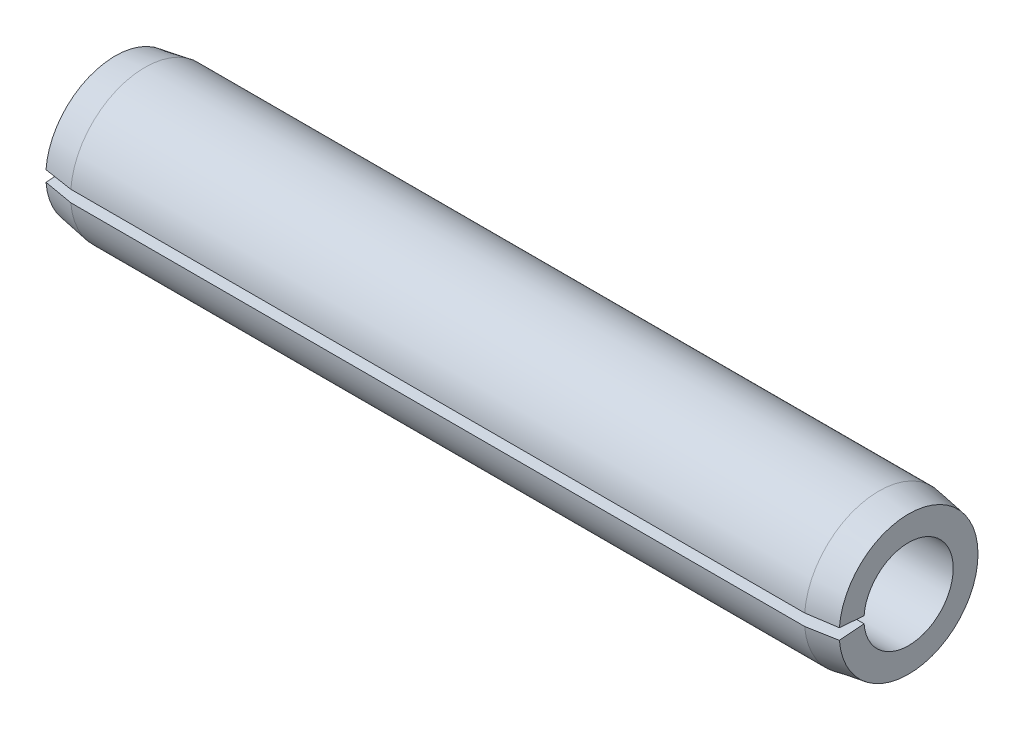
ISO-10303-21;
HEADER;
FILE_DESCRIPTION(('STEP AP214'),'2;1');
FILE_NAME('part.step','',(''),(''),'','','');
FILE_SCHEMA(('AUTOMOTIVE_DESIGN { 1 0 10303 214 1 1 1 1 }'));
ENDSEC;
DATA;
#1=APPLICATION_CONTEXT('core data for automotive mechanical design processes');
#2=APPLICATION_PROTOCOL_DEFINITION('international standard','automotive_design',2000,#1);
#3=PRODUCT_CONTEXT('',#1,'mechanical');
#4=PRODUCT('Part','Part','',(#3));
#5=PRODUCT_RELATED_PRODUCT_CATEGORY('part','',(#4));
#6=PRODUCT_DEFINITION_FORMATION('','',#4);
#7=PRODUCT_DEFINITION_CONTEXT('part definition',#1,'design');
#8=PRODUCT_DEFINITION('design','',#6,#7);
#9=PRODUCT_DEFINITION_SHAPE('','',#8);
#10=(LENGTH_UNIT() NAMED_UNIT(*) SI_UNIT(.MILLI.,.METRE.));
#11=(NAMED_UNIT(*) PLANE_ANGLE_UNIT() SI_UNIT($,.RADIAN.));
#12=(NAMED_UNIT(*) SI_UNIT($,.STERADIAN.) SOLID_ANGLE_UNIT());
#13=UNCERTAINTY_MEASURE_WITH_UNIT(LENGTH_MEASURE(1.E-05),#10,'distance_accuracy_value','');
#14=(GEOMETRIC_REPRESENTATION_CONTEXT(3) GLOBAL_UNCERTAINTY_ASSIGNED_CONTEXT((#13)) GLOBAL_UNIT_ASSIGNED_CONTEXT((#10,
#11,#12)) REPRESENTATION_CONTEXT('',''));
#15=CARTESIAN_POINT('',(0.,0.,0.));
#16=DIRECTION('',(0.,0.,1.));
#17=DIRECTION('',(1.,0.,0.));
#18=AXIS2_PLACEMENT_3D('',#15,#16,#17);
#19=CARTESIAN_POINT('',(0.,8.89,0.));
#20=DIRECTION('',(1.,0.,0.));
#21=DIRECTION('',(0.,0.,-1.));
#22=AXIS2_PLACEMENT_3D('',#19,#20,#21);
#23=PLANE('',#22);
#24=DIRECTION('',(0.,0.0784590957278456,0.996917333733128));
#25=VECTOR('',#24,1.);
#26=CARTESIAN_POINT('',(0.,0.,0.));
#27=LINE('',#26,#25);
#28=CARTESIAN_POINT('',(0.,0.448393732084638,5.69738256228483));
#29=VERTEX_POINT('',#28);
#30=CARTESIAN_POINT('',(0.,0.697501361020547,8.86259509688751));
#31=VERTEX_POINT('',#30);
#32=EDGE_CURVE('E82',#29,#31,#27,.T.);
#33=ORIENTED_EDGE('',*,*,#32,.T.);
#34=CARTESIAN_POINT('',(0.,0.,0.));
#35=DIRECTION('',(-1.,0.,0.));
#36=DIRECTION('',(0.,0.,1.));
#37=AXIS2_PLACEMENT_3D('',#34,#35,#36);
#38=CIRCLE('',#37,8.89);
#39=CARTESIAN_POINT('',(0.,-0.697501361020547,8.86259509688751));
#40=VERTEX_POINT('',#39);
#41=EDGE_CURVE('E100',#31,#40,#38,.T.);
#42=ORIENTED_EDGE('',*,*,#41,.T.);
#43=DIRECTION('',(0.,-0.0784590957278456,0.996917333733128));
#44=VECTOR('',#43,1.);
#45=CARTESIAN_POINT('',(0.,0.,0.));
#46=LINE('',#45,#44);
#47=CARTESIAN_POINT('',(0.,-0.448393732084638,5.69738256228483));
#48=VERTEX_POINT('',#47);
#49=EDGE_CURVE('E54',#48,#40,#46,.T.);
#50=ORIENTED_EDGE('',*,*,#49,.F.);
#51=CARTESIAN_POINT('',(0.,0.,0.));
#52=DIRECTION('',(-1.,0.,0.));
#53=DIRECTION('',(0.,0.,1.));
#54=AXIS2_PLACEMENT_3D('',#51,#52,#53);
#55=CIRCLE('',#54,5.715);
#56=EDGE_CURVE('E97',#29,#48,#55,.T.);
#57=ORIENTED_EDGE('',*,*,#56,.F.);
#58=EDGE_LOOP('',(#33,#42,#50,#57));
#59=FACE_BOUND('',#58,.T.);
#60=ADVANCED_FACE('F33',(#59),#23,.F.);
#61=CARTESIAN_POINT('',(-9.52499999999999,0.,0.));
#62=DIRECTION('',(-1.,0.,0.));
#63=DIRECTION('',(0.,0.,1.));
#64=AXIS2_PLACEMENT_3D('',#61,#62,#63);
#65=CYLINDRICAL_SURFACE('',#64,5.715);
#66=DIRECTION('',(-1.,0.,0.));
#67=VECTOR('',#66,1.);
#68=CARTESIAN_POINT('',(-9.52499999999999,0.448393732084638,5.69738256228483));
#69=LINE('',#68,#67);
#70=CARTESIAN_POINT('',(101.6,0.448393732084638,5.69738256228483));
#71=VERTEX_POINT('',#70);
#72=EDGE_CURVE('E85',#29,#71,#69,.F.);
#73=ORIENTED_EDGE('',*,*,#72,.F.);
#74=ORIENTED_EDGE('',*,*,#56,.T.);
#75=DIRECTION('',(-1.,0.,0.));
#76=VECTOR('',#75,1.);
#77=CARTESIAN_POINT('',(-9.52499999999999,-0.448393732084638,5.69738256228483));
#78=LINE('',#77,#76);
#79=CARTESIAN_POINT('',(101.6,-0.448393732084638,5.69738256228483));
#80=VERTEX_POINT('',#79);
#81=EDGE_CURVE('E118',#48,#80,#78,.F.);
#82=ORIENTED_EDGE('',*,*,#81,.T.);
#83=CARTESIAN_POINT('',(101.6,0.,0.));
#84=DIRECTION('',(-1.,0.,0.));
#85=DIRECTION('',(0.,0.,1.));
#86=AXIS2_PLACEMENT_3D('',#83,#84,#85);
#87=CIRCLE('',#86,5.715);
#88=EDGE_CURVE('E99',#71,#80,#87,.T.);
#89=ORIENTED_EDGE('',*,*,#88,.F.);
#90=EDGE_LOOP('',(#73,#74,#82,#89));
#91=FACE_BOUND('',#90,.T.);
#92=ADVANCED_FACE('F95',(#91),#65,.F.);
#93=CARTESIAN_POINT('',(101.6,5.715,0.));
#94=DIRECTION('',(-1.,0.,0.));
#95=DIRECTION('',(0.,0.,1.));
#96=AXIS2_PLACEMENT_3D('',#93,#94,#95);
#97=PLANE('',#96);
#98=DIRECTION('',(0.,0.0784590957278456,0.996917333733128));
#99=VECTOR('',#98,1.);
#100=CARTESIAN_POINT('',(101.6,0.,0.));
#101=LINE('',#100,#99);
#102=CARTESIAN_POINT('',(101.6,0.697501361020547,8.86259509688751));
#103=VERTEX_POINT('',#102);
#104=EDGE_CURVE('E127',#71,#103,#101,.T.);
#105=ORIENTED_EDGE('',*,*,#104,.F.);
#106=ORIENTED_EDGE('',*,*,#88,.T.);
#107=DIRECTION('',(0.,-0.0784590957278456,0.996917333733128));
#108=VECTOR('',#107,1.);
#109=CARTESIAN_POINT('',(101.6,0.,0.));
#110=LINE('',#109,#108);
#111=CARTESIAN_POINT('',(101.6,-0.697501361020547,8.86259509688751));
#112=VERTEX_POINT('',#111);
#113=EDGE_CURVE('E126',#80,#112,#110,.T.);
#114=ORIENTED_EDGE('',*,*,#113,.T.);
#115=CARTESIAN_POINT('',(101.6,0.,0.));
#116=DIRECTION('',(-1.,0.,0.));
#117=DIRECTION('',(0.,0.,1.));
#118=AXIS2_PLACEMENT_3D('',#115,#116,#117);
#119=CIRCLE('',#118,8.89);
#120=EDGE_CURVE('E104',#103,#112,#119,.T.);
#121=ORIENTED_EDGE('',*,*,#120,.F.);
#122=EDGE_LOOP('',(#105,#106,#114,#121));
#123=FACE_BOUND('',#122,.T.);
#124=ADVANCED_FACE('F137',(#123),#97,.F.);
#125=CARTESIAN_POINT('',(101.6,0.,0.));
#126=DIRECTION('',(-1.,0.,0.));
#127=DIRECTION('',(0.,0.,1.));
#128=AXIS2_PLACEMENT_3D('',#125,#126,#127);
#129=CONICAL_SURFACE('',#128,8.89,0.165148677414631);
#130=DIRECTION('',(-0.986393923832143,0.0128985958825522,0.163892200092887));
#131=VECTOR('',#130,1.);
#132=CARTESIAN_POINT('',(154.939999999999,0.,0.));
#133=LINE('',#132,#131);
#134=CARTESIAN_POINT('',(97.79,0.74732288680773,9.49563760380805));
#135=VERTEX_POINT('',#134);
#136=EDGE_CURVE('E101',#103,#135,#133,.T.);
#137=ORIENTED_EDGE('',*,*,#136,.F.);
#138=ORIENTED_EDGE('',*,*,#120,.T.);
#139=DIRECTION('',(-0.986393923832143,-0.0128985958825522,0.163892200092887));
#140=VECTOR('',#139,1.);
#141=CARTESIAN_POINT('',(154.939999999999,0.,0.));
#142=LINE('',#141,#140);
#143=CARTESIAN_POINT('',(97.79,-0.74732288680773,9.49563760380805));
#144=VERTEX_POINT('',#143);
#145=EDGE_CURVE('E120',#112,#144,#142,.T.);
#146=ORIENTED_EDGE('',*,*,#145,.T.);
#147=CARTESIAN_POINT('',(97.79,0.,0.));
#148=DIRECTION('',(-1.,0.,0.));
#149=DIRECTION('',(0.,0.,1.));
#150=AXIS2_PLACEMENT_3D('',#147,#148,#149);
#151=CIRCLE('',#150,9.52500000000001);
#152=EDGE_CURVE('E109',#135,#144,#151,.T.);
#153=ORIENTED_EDGE('',*,*,#152,.F.);
#154=EDGE_LOOP('',(#137,#138,#146,#153));
#155=FACE_BOUND('',#154,.T.);
#156=ADVANCED_FACE('F136',(#155),#129,.T.);
#157=CARTESIAN_POINT('',(-9.52499999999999,0.,0.));
#158=DIRECTION('',(-1.,0.,0.));
#159=DIRECTION('',(0.,0.,1.));
#160=AXIS2_PLACEMENT_3D('',#157,#158,#159);
#161=CYLINDRICAL_SURFACE('',#160,9.52500000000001);
#162=DIRECTION('',(-1.,0.,0.));
#163=VECTOR('',#162,1.);
#164=CARTESIAN_POINT('',(-9.52499999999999,0.74732288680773,9.49563760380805));
#165=LINE('',#164,#163);
#166=CARTESIAN_POINT('',(3.81,0.747322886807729,9.49563760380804));
#167=VERTEX_POINT('',#166);
#168=EDGE_CURVE('E46',#135,#167,#165,.T.);
#169=ORIENTED_EDGE('',*,*,#168,.F.);
#170=ORIENTED_EDGE('',*,*,#152,.T.);
#171=DIRECTION('',(-1.,0.,0.));
#172=VECTOR('',#171,1.);
#173=CARTESIAN_POINT('',(-9.52499999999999,-0.74732288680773,9.49563760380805));
#174=LINE('',#173,#172);
#175=CARTESIAN_POINT('',(3.81,-0.747322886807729,9.49563760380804));
#176=VERTEX_POINT('',#175);
#177=EDGE_CURVE('E123',#144,#176,#174,.T.);
#178=ORIENTED_EDGE('',*,*,#177,.T.);
#179=CARTESIAN_POINT('',(3.81,0.,0.));
#180=DIRECTION('',(-1.,0.,0.));
#181=DIRECTION('',(0.,0.,1.));
#182=AXIS2_PLACEMENT_3D('',#179,#180,#181);
#183=CIRCLE('',#182,9.525);
#184=EDGE_CURVE('E112',#167,#176,#183,.T.);
#185=ORIENTED_EDGE('',*,*,#184,.F.);
#186=EDGE_LOOP('',(#169,#170,#178,#185));
#187=FACE_BOUND('',#186,.T.);
#188=ADVANCED_FACE('F140',(#187),#161,.T.);
#189=CARTESIAN_POINT('',(3.81,0.,0.));
#190=DIRECTION('',(1.,0.,0.));
#191=DIRECTION('',(0.,0.,-1.));
#192=AXIS2_PLACEMENT_3D('',#189,#190,#191);
#193=CONICAL_SURFACE('',#192,9.525,0.165148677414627);
#194=DIRECTION('',(-0.986393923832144,-0.0128985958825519,-0.163892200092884));
#195=VECTOR('',#194,1.);
#196=CARTESIAN_POINT('',(-53.3399999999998,0.,0.));
#197=LINE('',#196,#195);
#198=EDGE_CURVE('E11',#167,#31,#197,.T.);
#199=ORIENTED_EDGE('',*,*,#198,.F.);
#200=ORIENTED_EDGE('',*,*,#184,.T.);
#201=DIRECTION('',(-0.986393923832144,0.0128985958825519,-0.163892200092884));
#202=VECTOR('',#201,1.);
#203=CARTESIAN_POINT('',(-53.3399999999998,0.,0.));
#204=LINE('',#203,#202);
#205=EDGE_CURVE('E40',#176,#40,#204,.T.);
#206=ORIENTED_EDGE('',*,*,#205,.T.);
#207=ORIENTED_EDGE('',*,*,#41,.F.);
#208=EDGE_LOOP('',(#199,#200,#206,#207));
#209=FACE_BOUND('',#208,.T.);
#210=ADVANCED_FACE('F143',(#209),#193,.T.);
#211=CARTESIAN_POINT('',(101.6,0.,0.));
#212=DIRECTION('',(0.,-0.996917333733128,-0.0784590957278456));
#213=DIRECTION('',(0.,0.0784590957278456,-0.996917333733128));
#214=AXIS2_PLACEMENT_3D('',#211,#212,#213);
#215=PLANE('',#214);
#216=ORIENTED_EDGE('',*,*,#49,.T.);
#217=ORIENTED_EDGE('',*,*,#205,.F.);
#218=ORIENTED_EDGE('',*,*,#177,.F.);
#219=ORIENTED_EDGE('',*,*,#145,.F.);
#220=ORIENTED_EDGE('',*,*,#113,.F.);
#221=ORIENTED_EDGE('',*,*,#81,.F.);
#222=EDGE_LOOP('',(#216,#217,#218,#219,#220,#221));
#223=FACE_BOUND('',#222,.T.);
#224=ADVANCED_FACE('F138',(#223),#215,.F.);
#225=CARTESIAN_POINT('',(101.6,0.,0.));
#226=DIRECTION('',(0.,-0.996917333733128,0.0784590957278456));
#227=DIRECTION('',(0.,-0.0784590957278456,-0.996917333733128));
#228=AXIS2_PLACEMENT_3D('',#225,#226,#227);
#229=PLANE('',#228);
#230=ORIENTED_EDGE('',*,*,#72,.T.);
#231=ORIENTED_EDGE('',*,*,#104,.T.);
#232=ORIENTED_EDGE('',*,*,#136,.T.);
#233=ORIENTED_EDGE('',*,*,#168,.T.);
#234=ORIENTED_EDGE('',*,*,#198,.T.);
#235=ORIENTED_EDGE('',*,*,#32,.F.);
#236=EDGE_LOOP('',(#230,#231,#232,#233,#234,#235));
#237=FACE_BOUND('',#236,.T.);
#238=ADVANCED_FACE('F84',(#237),#229,.T.);
#239=CLOSED_SHELL('',(#60,#92,#124,#156,#188,#210,#224,#238));
#240=MANIFOLD_SOLID_BREP('B2',#239);
#241=ADVANCED_BREP_SHAPE_REPRESENTATION('',(#18,#240),#14);
#242=SHAPE_DEFINITION_REPRESENTATION(#9,#241);
ENDSEC;
END-ISO-10303-21;
